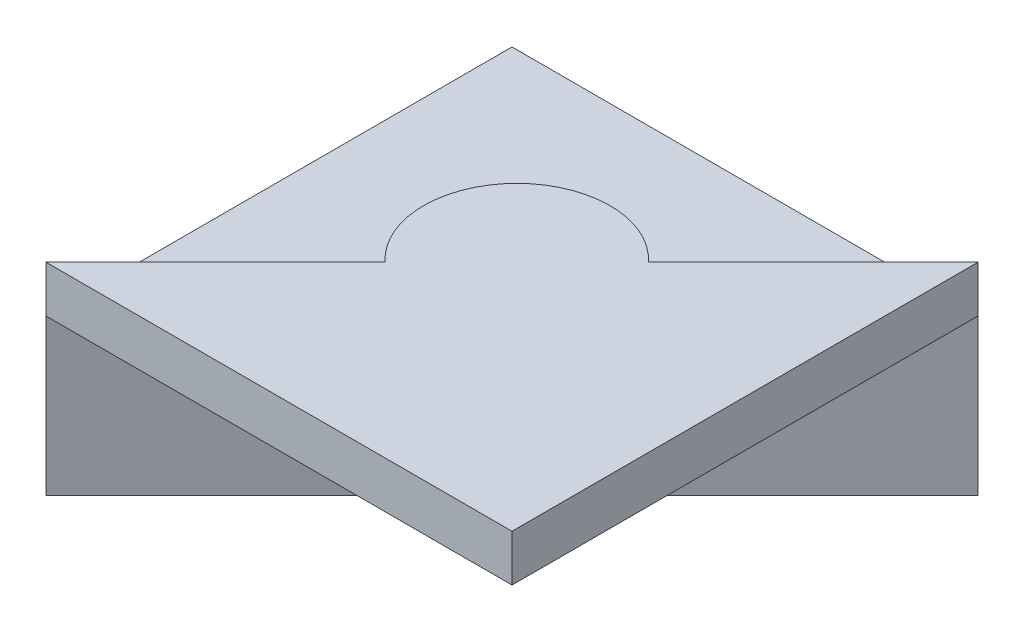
from build123d import *

# Parameters (mm, degrees)
EXTRUDE1_DEPTH = 10
EXTRUDE4_DEPTH = 3


with BuildPart() as part:
    # Sketch1 → Extrude1 (new body)
    with BuildSketch(Plane(origin=(0, 0, 0), x_dir=(1, 0, 0), z_dir=(0, 1, 0))):
        with BuildLine():
            Line((0, 0), (-30, 0))
            Line((-30, 0), (-30, -30))
            Line((-30, -30), (-19.086324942, -19.086324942))
            ThreePointArc((-19.086324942, -19.086324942), (-19.242640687, -10.450285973), (-10.606601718, -10.606601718))
            Line((-10.606601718, -10.606601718), (0, 0))
        make_face()
    extrude(amount=EXTRUDE1_DEPTH)


with BuildPart() as body_2:
    # Sketch4 → Extrude4 (new body)
    with BuildSketch(Plane(origin=(0, 10, 0), x_dir=(-1, 0, 0), z_dir=(0, 1, 0))):
        with BuildLine():
            Line((10.606601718, 10.606601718), (0, 0))
            Line((0, 0), (0, 30))
            Line((0, 30), (30, 30))
            Line((30, 30), (19.086324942, 19.086324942))
            ThreePointArc((19.086324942, 19.086324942), (19.242640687, 10.450285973), (10.606601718, 10.606601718))
        make_face()
    extrude(amount=EXTRUDE4_DEPTH)


solid = Compound([part.part, body_2.part])
